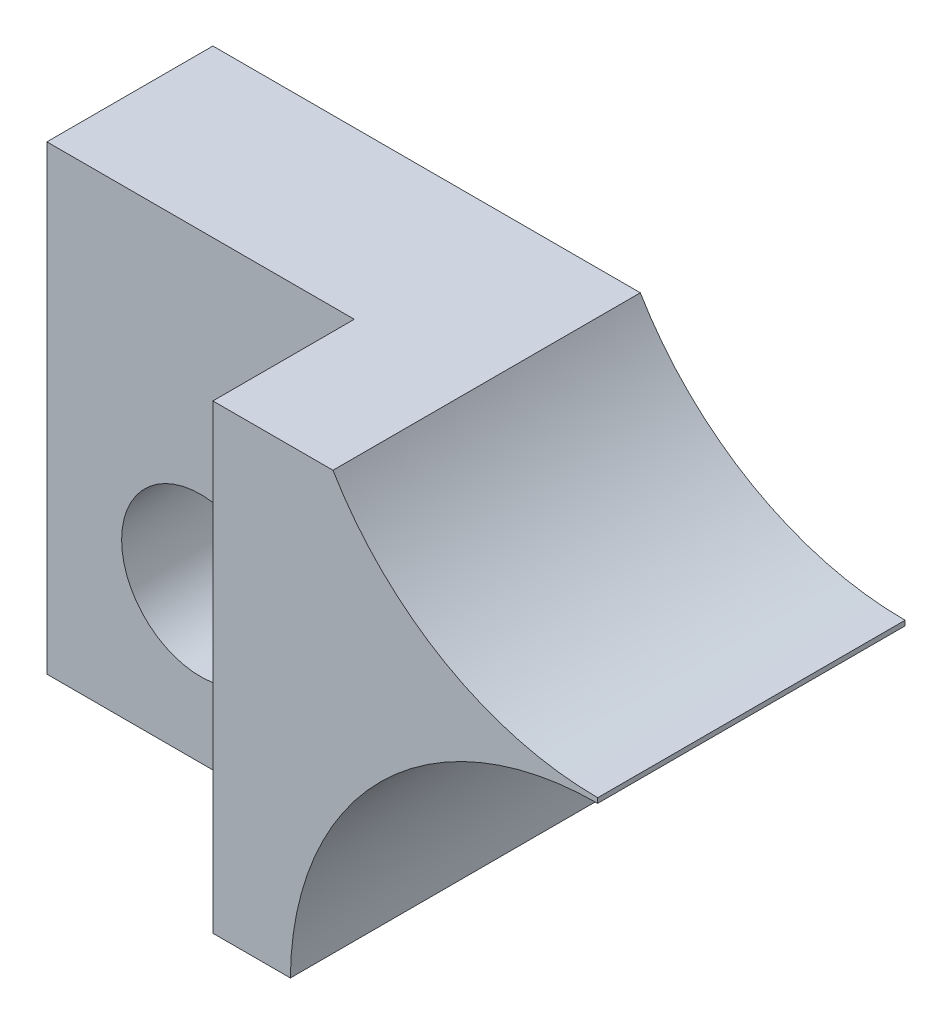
from build123d import *

# Parameters (mm, degrees)
SKETCH1_R           = 1.63195
EXTRUDE1_DEPTH      = 6.35
SKETCH5_W           = 15.98667914
SKETCH5_H           = 1.5875
CUT_EXTRUDE4_DEPTH  = 116.178567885
SKETCH6_W           = 6.35
SKETCH6_H           = 2.921
CUT_EXTRUDE5_DEPTH  = 116.178567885
CUT_EXTRUDE6_DEPTH  = 115.75110634
CUT_EXTRUDE7_DEPTH  = 115.871833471
SKETCH9_R           = 1.63195
CUT_EXTRUDE8_DEPTH  = 6.35
EXTRUDE2_DEPTH      = 10
EXTRUDE2_DEPTH_BACK = 116.178567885


with BuildPart() as part:
    # Sketch1 → Extrude1 (new body)
    with BuildSketch(Plane.XY):
        with BuildLine():
            Line((0, 9.525), (0, 0))
            Line((0, 0), (7.950403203, 0))
            ThreePointArc((7.950403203, 0), (12.65282779, 6.081790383), (19.769817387, 3.175))
            Line((19.769817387, 3.175), (91.355182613, 3.175))
            ThreePointArc((91.355182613, 3.175), (96.8248, 6.2992), (102.294417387, 3.175))
            Line((102.294417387, 3.175), (114.3, 3.175))
            Line((114.3, 3.175), (114.3, 12.7))
            Line((114.3, 12.7), (103.174596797, 12.7))
            ThreePointArc((103.174596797, 12.7), (98.47217221, 6.618209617), (91.355182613, 9.525))
            Line((91.355182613, 9.525), (19.769817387, 9.525))
            ThreePointArc((19.769817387, 9.525), (14.3002, 6.4008), (8.830582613, 9.525))
            Line((8.830582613, 9.525), (0, 9.525))
        make_face()
        with BuildLine():
            Line((109.22, 11.15695), (111.76, 11.15695))
            ThreePointArc((111.76, 11.15695), (113.39195, 9.525), (111.76, 7.89305))
            Line((111.76, 7.89305), (109.22, 7.89305))
            ThreePointArc((109.22, 7.89305), (107.58805, 9.525), (109.22, 11.15695))
        make_face(mode=Mode.SUBTRACT)
        with Locations(Location((3.175, 3.175, 0), (0, 0, 180))):
            Circle(SKETCH1_R, mode=Mode.SUBTRACT)
    extrude(amount=EXTRUDE1_DEPTH)

    # Sketch5 → Cut-Extrude4 (cut, through all)
    with BuildSketch(Plane(origin=(0, 0, 0), x_dir=(-1, 0, 0), z_dir=(0, 0, -1))):
        with Locations((-106.30666043, 3.96875)):
            Rectangle(SKETCH5_W, SKETCH5_H)
    extrude(amount=-CUT_EXTRUDE4_DEPTH, mode=Mode.SUBTRACT)

    # Sketch6 → Cut-Extrude5 (cut, through all)
    with BuildSketch(Plane.XZ):
        with Locations((3.175, 4.8895)):
            Rectangle(SKETCH6_W, SKETCH6_H)
    extrude(amount=-CUT_EXTRUDE5_DEPTH, mode=Mode.SUBTRACT)

    # Sketch7 → Cut-Extrude6 (cut, through all)
    with BuildSketch(Plane.XZ.offset(-4.7625)):
        with BuildLine():
            Line((114.3, 6.35), (104.775, 6.35))
            Line((104.775, 6.35), (104.775, 5.715))
            ThreePointArc((104.775, 5.715), (105.518948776, 3.918948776), (107.315, 3.175))
            Line((107.315, 3.175), (114.3, 3.175))
            Line((114.3, 3.175), (114.3, 6.35))
        make_face()
    extrude(amount=-CUT_EXTRUDE6_DEPTH, mode=Mode.SUBTRACT)

    # Sketch8 → Cut-Extrude7 (cut, through all)
    with BuildSketch(Plane.XZ.offset(-3.175)):
        with BuildLine():
            Line((25.4, 6.35), (25.4, 3.556))
            ThreePointArc((25.4, 3.556), (25.848403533, 5.182744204), (27.066958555, 6.35))
            Line((27.066958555, 6.35), (25.4, 6.35))
        make_face()
        with BuildLine():
            Line((31.75, 3.556), (31.75, 6.35))
            Line((31.75, 6.35), (30.083041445, 6.35))
            ThreePointArc((30.083041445, 6.35), (31.301596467, 5.182744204), (31.75, 3.556))
        make_face()
        with BuildLine():
            Line((25.4, 3.556), (31.75, 3.556))
            ThreePointArc((31.75, 3.556), (31.301596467, 5.182744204), (30.083041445, 6.35))
            Line((30.083041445, 6.35), (27.066958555, 6.35))
            ThreePointArc((27.066958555, 6.35), (25.848403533, 5.182744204), (25.4, 3.556))
        make_face()
        with BuildLine():
            ThreePointArc((25.4, 3.556), (28.575, 0.381), (31.75, 3.556))
            Line((31.75, 3.556), (25.4, 3.556))
        make_face()
        with BuildLine():
            Line((79.375, 6.35), (79.375, 3.556))
            ThreePointArc((79.375, 3.556), (79.823403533, 5.182744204), (81.041958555, 6.35))
            Line((81.041958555, 6.35), (79.375, 6.35))
        make_face()
        with BuildLine():
            Line((79.375, 3.556), (85.725, 3.556))
            ThreePointArc((85.725, 3.556), (85.276596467, 5.182744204), (84.058041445, 6.35))
            Line((84.058041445, 6.35), (81.041958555, 6.35))
            ThreePointArc((81.041958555, 6.35), (79.823403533, 5.182744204), (79.375, 3.556))
        make_face()
        with BuildLine():
            ThreePointArc((84.058041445, 6.35), (85.276596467, 5.182744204), (85.725, 3.556))
            Line((85.725, 3.556), (85.725, 6.35))
            Line((85.725, 6.35), (84.058041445, 6.35))
        make_face()
        with BuildLine():
            ThreePointArc((79.375, 3.556), (82.55, 0.381), (85.725, 3.556))
            Line((85.725, 3.556), (79.375, 3.556))
        make_face()
    extrude(amount=-CUT_EXTRUDE7_DEPTH, mode=Mode.SUBTRACT)

    # Sketch9 → Cut-Extrude8 (cut)
    with BuildSketch(Plane.XY.offset(6.35)):
        with Locations((39.37, 6.35)):
            Circle(SKETCH9_R)
        with Locations((74.93, 6.35)):
            Circle(SKETCH9_R)
    extrude(amount=-CUT_EXTRUDE8_DEPTH, mode=Mode.SUBTRACT)

    # Sketch10 → Extrude2 (cut, two sides: drawn at the far end of the back side and taken through both)
    with BuildSketch(Plane.XY.offset(6.35).offset(-EXTRUDE2_DEPTH_BACK)):
        Polygon((14.3002, 12.7508), (14.3002, -23.204967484), (128.929166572, -23.204967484), (128.929166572, 12.7508), (128.929166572, 25.4508), (14.3002, 25.4508), align=None)
    extrude(amount=EXTRUDE2_DEPTH + EXTRUDE2_DEPTH_BACK, mode=Mode.SUBTRACT)


solid = part.part
